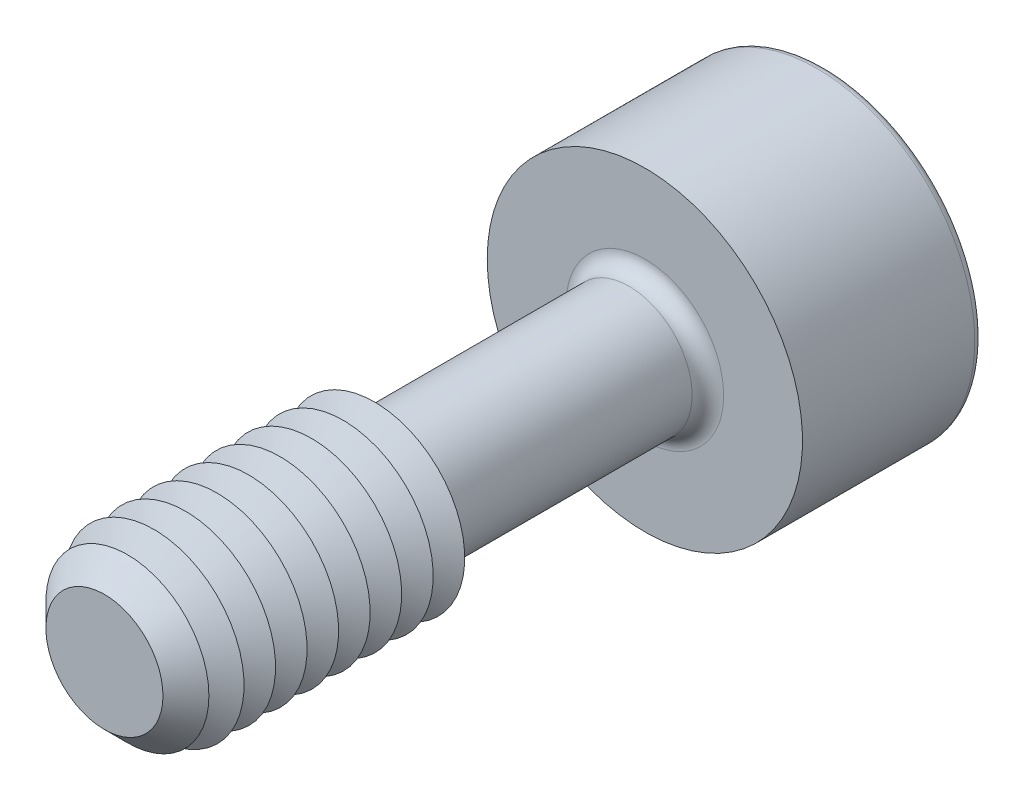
from build123d import *

# Parameters (mm, degrees)
SKETCH1_R       = 1.4
EXTRUDE1_DEPTH  = 6
CHAMFER1_SIZE   = 0.7
SKETCH3_R       = 3.5
EXTRUDE2_DEPTH  = 4
EXTRUDE3_DEPTH  = 3
FILLET1_R       = 0.35
FILLET2_R       = 0.175
LPATTERN1_COUNT = 8
LPATTERN1_PITCH = 0.7


with BuildPart() as part:
    # Sketch1 → Extrude1 (new, symmetric)
    with BuildSketch(Plane.XY):
        Circle(SKETCH1_R)
    extrude(amount=EXTRUDE1_DEPTH, both=True)

    # Sketch2 → Revolve1 (revolve)
    with BuildSketch(Plane(origin=(0, 0, 0), x_dir=(0, 0, -1), z_dir=(1, 0, 0))):
        Polygon((-6, 0), (-6, 2), (0, 2), (0.346410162, 1.4), (0.346410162, 0), align=None)
    revolve(axis=Axis((0, 0, -0.346410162), (0, 0, 1)))

    # Chamfer1
    chamfer1_edges = [part.edges().sort_by_distance(p)[0] for p in [
        (0, -2, 6),
    ]]
    chamfer(chamfer1_edges, length=CHAMFER1_SIZE)

    # Sketch3 → Extrude2 (add)
    with BuildSketch(Plane(origin=(0, 0, -6), x_dir=(-1, 0, 0), z_dir=(0, 0, -1))):
        Circle(SKETCH3_R)
    extrude(amount=EXTRUDE2_DEPTH)

    # Sketch4 → Extrude3 (cut)
    with BuildSketch(Plane(origin=(-13.7, 0, -10), x_dir=(1, 0, 0), z_dir=(0, 0, 1))):
        Polygon((12.833974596, -1.5), (14.566025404, -1.5), (15.432050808, 0), (14.566025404, 1.5), (12.833974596, 1.5), (11.967949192, 0), align=None)
    extrude(amount=EXTRUDE3_DEPTH, mode=Mode.SUBTRACT)

    # Fillet1
    fillet1_edges = [part.edges().sort_by_distance(p)[0] for p in [
        (-1.4, 0, -6),
    ]]
    fillet(fillet1_edges, radius=FILLET1_R)

    # Fillet2
    fillet2_edges = [part.edges().sort_by_distance(p)[0] for p in [
        (3.5, 0, -10),
    ]]
    fillet(fillet2_edges, radius=FILLET2_R)

    # Sketch5 → Cut-Revolve1 (revolve, cut)
    with BuildSketch(Plane(origin=(0, 0, 0), x_dir=(0, 0, -1), z_dir=(1, 0, 0)), mode=Mode.PRIVATE) as cut_revolve1_sk:
        Polygon((7, 0), (7, -1.5), (6.133974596, 0), align=None)
    revolve(cut_revolve1_sk.sketch.rotate(Axis((0, 0, -6.133974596), (0, 0, -1)), 90), axis=Axis((0, 0, -6.133974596), (0, 0, -1)), mode=Mode.SUBTRACT)

    # Sketch7 → Cut-Revolve2 (revolve, cut)
    with BuildSketch(Plane(origin=(0, 0, 0), x_dir=(0, 0, -1), z_dir=(1, 0, 0)), mode=Mode.PRIVATE) as cut_revolve2_sk:
        Polygon((0, 2), (-0.35, 1.393782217), (-0.7, 2), align=None)
    cut_revolve2 = revolve(cut_revolve2_sk.sketch.rotate(Axis((0, 0, -1.332048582), (0, 0, 1)), 90), axis=Axis((0, 0, -1.332048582), (0, 0, 1)), mode=Mode.SUBTRACT)

    # LPattern1: Cut-Revolve2 ×8
    with Locations(*[(0, 0, i * LPATTERN1_PITCH) for i in range(1, LPATTERN1_COUNT)]):
        add(cut_revolve2, mode=Mode.SUBTRACT)


solid = part.part
